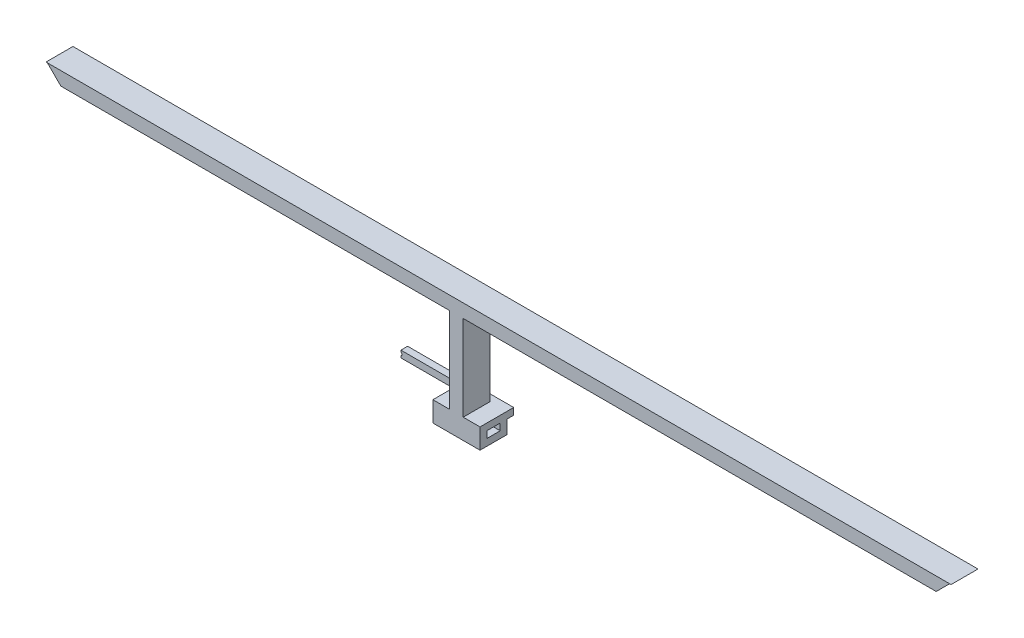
ISO-10303-21;
HEADER;
FILE_DESCRIPTION(('STEP AP214'),'2;1');
FILE_NAME('part.step','',(''),(''),'','','');
FILE_SCHEMA(('AUTOMOTIVE_DESIGN { 1 0 10303 214 1 1 1 1 }'));
ENDSEC;
DATA;
#1=APPLICATION_CONTEXT('core data for automotive mechanical design processes');
#2=APPLICATION_PROTOCOL_DEFINITION('international standard','automotive_design',2000,#1);
#3=PRODUCT_CONTEXT('',#1,'mechanical');
#4=PRODUCT('Part','Part','',(#3));
#5=PRODUCT_RELATED_PRODUCT_CATEGORY('part','',(#4));
#6=PRODUCT_DEFINITION_FORMATION('','',#4);
#7=PRODUCT_DEFINITION_CONTEXT('part definition',#1,'design');
#8=PRODUCT_DEFINITION('design','',#6,#7);
#9=PRODUCT_DEFINITION_SHAPE('','',#8);
#10=(LENGTH_UNIT() NAMED_UNIT(*) SI_UNIT(.MILLI.,.METRE.));
#11=(NAMED_UNIT(*) PLANE_ANGLE_UNIT() SI_UNIT($,.RADIAN.));
#12=(NAMED_UNIT(*) SI_UNIT($,.STERADIAN.) SOLID_ANGLE_UNIT());
#13=UNCERTAINTY_MEASURE_WITH_UNIT(LENGTH_MEASURE(1.E-05),#10,'distance_accuracy_value','');
#14=(GEOMETRIC_REPRESENTATION_CONTEXT(3) GLOBAL_UNCERTAINTY_ASSIGNED_CONTEXT((#13)) GLOBAL_UNIT_ASSIGNED_CONTEXT((#10,
#11,#12)) REPRESENTATION_CONTEXT('',''));
#15=CARTESIAN_POINT('',(0.,0.,0.));
#16=DIRECTION('',(0.,0.,1.));
#17=DIRECTION('',(1.,0.,0.));
#18=AXIS2_PLACEMENT_3D('',#15,#16,#17);
#19=CARTESIAN_POINT('',(35.,10.,-20.));
#20=DIRECTION('',(0.,0.,1.));
#21=DIRECTION('',(1.,0.,0.));
#22=AXIS2_PLACEMENT_3D('',#19,#20,#21);
#23=PLANE('',#22);
#24=DIRECTION('',(1.,0.,0.));
#25=VECTOR('',#24,1.);
#26=CARTESIAN_POINT('',(35.,10.,-20.));
#27=LINE('',#26,#25);
#28=CARTESIAN_POINT('',(-10.,10.,-20.));
#29=VERTEX_POINT('',#28);
#30=CARTESIAN_POINT('',(10.,10.,-20.));
#31=VERTEX_POINT('',#30);
#32=EDGE_CURVE('E11',#29,#31,#27,.T.);
#33=ORIENTED_EDGE('',*,*,#32,.F.);
#34=DIRECTION('',(0.,-1.,0.));
#35=VECTOR('',#34,1.);
#36=CARTESIAN_POINT('',(-10.,137.,-20.));
#37=LINE('',#36,#35);
#38=CARTESIAN_POINT('',(-10.,137.,-20.));
#39=VERTEX_POINT('',#38);
#40=EDGE_CURVE('E592',#39,#29,#37,.T.);
#41=ORIENTED_EDGE('',*,*,#40,.F.);
#42=DIRECTION('',(-1.,0.,0.));
#43=VECTOR('',#42,1.);
#44=CARTESIAN_POINT('',(734.483,137.,-20.));
#45=LINE('',#44,#43);
#46=CARTESIAN_POINT('',(-587.445932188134,137.,-20.));
#47=VERTEX_POINT('',#46);
#48=EDGE_CURVE('E267',#39,#47,#45,.T.);
#49=ORIENTED_EDGE('',*,*,#48,.T.);
#50=DIRECTION('',(-0.707106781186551,0.707106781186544,0.));
#51=VECTOR('',#50,1.);
#52=CARTESIAN_POINT('',(-212.722966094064,-237.722966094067,-20.));
#53=LINE('',#52,#51);
#54=CARTESIAN_POINT('',(-605.981466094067,155.535533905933,-20.));
#55=VERTEX_POINT('',#54);
#56=EDGE_CURVE('E37',#47,#55,#53,.T.);
#57=ORIENTED_EDGE('',*,*,#56,.T.);
#58=CARTESIAN_POINT('',(-609.517,152.,-20.));
#59=DIRECTION('',(0.,0.,1.));
#60=DIRECTION('',(1.,0.,0.));
#61=AXIS2_PLACEMENT_3D('',#58,#59,#60);
#62=CIRCLE('',#61,5.);
#63=CARTESIAN_POINT('',(-609.517,157.,-20.));
#64=VERTEX_POINT('',#63);
#65=EDGE_CURVE('E252',#55,#64,#62,.T.);
#66=ORIENTED_EDGE('',*,*,#65,.T.);
#67=DIRECTION('',(-1.,0.,0.));
#68=VECTOR('',#67,1.);
#69=CARTESIAN_POINT('',(734.483,157.,-20.));
#70=LINE('',#69,#68);
#71=CARTESIAN_POINT('',(734.483,157.,-20.));
#72=VERTEX_POINT('',#71);
#73=EDGE_CURVE('E264',#72,#64,#70,.T.);
#74=ORIENTED_EDGE('',*,*,#73,.F.);
#75=CARTESIAN_POINT('',(734.483,152.,-20.));
#76=DIRECTION('',(0.,0.,1.));
#77=DIRECTION('',(1.,0.,0.));
#78=AXIS2_PLACEMENT_3D('',#75,#76,#77);
#79=CIRCLE('',#78,4.99999999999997);
#80=CARTESIAN_POINT('',(730.947466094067,155.535533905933,-20.));
#81=VERTEX_POINT('',#80);
#82=EDGE_CURVE('E237',#72,#81,#79,.T.);
#83=ORIENTED_EDGE('',*,*,#82,.T.);
#84=DIRECTION('',(-0.707106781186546,-0.707106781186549,0.));
#85=VECTOR('',#84,1.);
#86=CARTESIAN_POINT('',(310.205966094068,-265.205966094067,-20.));
#87=LINE('',#86,#85);
#88=CARTESIAN_POINT('',(712.411932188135,137.,-20.));
#89=VERTEX_POINT('',#88);
#90=EDGE_CURVE('E241',#81,#89,#87,.T.);
#91=ORIENTED_EDGE('',*,*,#90,.T.);
#92=CARTESIAN_POINT('',(10.,137.,-20.));
#93=VERTEX_POINT('',#92);
#94=EDGE_CURVE('E276',#89,#93,#45,.T.);
#95=ORIENTED_EDGE('',*,*,#94,.T.);
#96=DIRECTION('',(0.,-1.,0.));
#97=VECTOR('',#96,1.);
#98=CARTESIAN_POINT('',(10.,137.,-20.));
#99=LINE('',#98,#97);
#100=EDGE_CURVE('E597',#93,#31,#99,.T.);
#101=ORIENTED_EDGE('',*,*,#100,.T.);
#102=EDGE_LOOP('',(#33,#41,#49,#57,#66,#74,#83,#91,#95,#101));
#103=FACE_BOUND('',#102,.T.);
#104=ADVANCED_FACE('F28',(#103),#23,.F.);
#105=DIRECTION('',(-1.,0.,0.));
#106=VECTOR('',#105,1.);
#107=CARTESIAN_POINT('',(35.,0.,-20.));
#108=LINE('',#107,#106);
#109=CARTESIAN_POINT('',(35.,0.,-20.));
#110=VERTEX_POINT('',#109);
#111=CARTESIAN_POINT('',(-35.,0.,-20.));
#112=VERTEX_POINT('',#111);
#113=EDGE_CURVE('E45',#110,#112,#108,.T.);
#114=ORIENTED_EDGE('',*,*,#113,.F.);
#115=DIRECTION('',(0.,1.,0.));
#116=VECTOR('',#115,1.);
#117=CARTESIAN_POINT('',(35.,10.,-20.));
#118=LINE('',#117,#116);
#119=CARTESIAN_POINT('',(35.,-20.,-20.));
#120=VERTEX_POINT('',#119);
#121=EDGE_CURVE('E281',#120,#110,#118,.T.);
#122=ORIENTED_EDGE('',*,*,#121,.F.);
#123=DIRECTION('',(-1.,0.,0.));
#124=VECTOR('',#123,1.);
#125=CARTESIAN_POINT('',(35.,-20.,-20.));
#126=LINE('',#125,#124);
#127=CARTESIAN_POINT('',(-35.,-20.,-20.));
#128=VERTEX_POINT('',#127);
#129=EDGE_CURVE('E293',#120,#128,#126,.T.);
#130=ORIENTED_EDGE('',*,*,#129,.T.);
#131=DIRECTION('',(0.,1.,0.));
#132=VECTOR('',#131,1.);
#133=CARTESIAN_POINT('',(-35.,10.,-20.));
#134=LINE('',#133,#132);
#135=EDGE_CURVE('E311',#128,#112,#134,.T.);
#136=ORIENTED_EDGE('',*,*,#135,.T.);
#137=EDGE_LOOP('',(#114,#122,#130,#136));
#138=FACE_BOUND('',#137,.T.);
#139=ADVANCED_FACE('F310',(#138),#23,.F.);
#140=CARTESIAN_POINT('',(35.,10.,20.));
#141=DIRECTION('',(0.,-1.,0.));
#142=DIRECTION('',(0.,0.,-1.));
#143=AXIS2_PLACEMENT_3D('',#140,#141,#142);
#144=PLANE('',#143);
#145=DIRECTION('',(0.,0.,1.));
#146=VECTOR('',#145,1.);
#147=CARTESIAN_POINT('',(-10.,10.,-20.));
#148=LINE('',#147,#146);
#149=CARTESIAN_POINT('',(-10.,10.,20.));
#150=VERTEX_POINT('',#149);
#151=EDGE_CURVE('E571',#29,#150,#148,.T.);
#152=ORIENTED_EDGE('',*,*,#151,.F.);
#153=ORIENTED_EDGE('',*,*,#32,.T.);
#154=DIRECTION('',(0.,0.,-1.));
#155=VECTOR('',#154,1.);
#156=CARTESIAN_POINT('',(10.,10.,-20.));
#157=LINE('',#156,#155);
#158=CARTESIAN_POINT('',(10.,10.,20.));
#159=VERTEX_POINT('',#158);
#160=EDGE_CURVE('E566',#159,#31,#157,.T.);
#161=ORIENTED_EDGE('',*,*,#160,.F.);
#162=DIRECTION('',(-1.,0.,0.));
#163=VECTOR('',#162,1.);
#164=CARTESIAN_POINT('',(35.,10.,20.));
#165=LINE('',#164,#163);
#166=CARTESIAN_POINT('',(35.,10.,20.));
#167=VERTEX_POINT('',#166);
#168=EDGE_CURVE('E299',#167,#159,#165,.T.);
#169=ORIENTED_EDGE('',*,*,#168,.F.);
#170=DIRECTION('',(0.,0.,1.));
#171=VECTOR('',#170,1.);
#172=CARTESIAN_POINT('',(35.,10.,20.));
#173=LINE('',#172,#171);
#174=CARTESIAN_POINT('',(35.,10.,-30.));
#175=VERTEX_POINT('',#174);
#176=EDGE_CURVE('E283',#175,#167,#173,.T.);
#177=ORIENTED_EDGE('',*,*,#176,.F.);
#178=DIRECTION('',(1.,0.,0.));
#179=VECTOR('',#178,1.);
#180=CARTESIAN_POINT('',(35.,10.,-30.));
#181=LINE('',#180,#179);
#182=CARTESIAN_POINT('',(-122.517,10.,-30.));
#183=VERTEX_POINT('',#182);
#184=EDGE_CURVE('E638',#183,#175,#181,.T.);
#185=ORIENTED_EDGE('',*,*,#184,.F.);
#186=DIRECTION('',(0.,0.,1.));
#187=VECTOR('',#186,1.);
#188=CARTESIAN_POINT('',(-122.517,10.,-30.));
#189=LINE('',#188,#187);
#190=CARTESIAN_POINT('',(-122.517,10.,-20.));
#191=VERTEX_POINT('',#190);
#192=EDGE_CURVE('E636',#183,#191,#189,.T.);
#193=ORIENTED_EDGE('',*,*,#192,.T.);
#194=CARTESIAN_POINT('',(-35.,10.,-20.));
#195=VERTEX_POINT('',#194);
#196=EDGE_CURVE('E217',#191,#195,#27,.T.);
#197=ORIENTED_EDGE('',*,*,#196,.T.);
#198=DIRECTION('',(0.,0.,1.));
#199=VECTOR('',#198,1.);
#200=CARTESIAN_POINT('',(-35.,10.,20.));
#201=LINE('',#200,#199);
#202=CARTESIAN_POINT('',(-35.,10.,20.));
#203=VERTEX_POINT('',#202);
#204=EDGE_CURVE('E319',#195,#203,#201,.T.);
#205=ORIENTED_EDGE('',*,*,#204,.T.);
#206=EDGE_CURVE('E290',#150,#203,#165,.T.);
#207=ORIENTED_EDGE('',*,*,#206,.F.);
#208=EDGE_LOOP('',(#152,#153,#161,#169,#177,#185,#193,#197,#205,#207));
#209=FACE_BOUND('',#208,.T.);
#210=ADVANCED_FACE('F355',(#209),#144,.F.);
#211=CARTESIAN_POINT('',(35.,-20.,20.));
#212=DIRECTION('',(1.,0.,0.));
#213=DIRECTION('',(0.,0.,-1.));
#214=AXIS2_PLACEMENT_3D('',#211,#212,#213);
#215=PLANE('',#214);
#216=DIRECTION('',(0.,-1.,0.));
#217=VECTOR('',#216,1.);
#218=CARTESIAN_POINT('',(35.,10.,20.));
#219=LINE('',#218,#217);
#220=CARTESIAN_POINT('',(35.,-20.,20.));
#221=VERTEX_POINT('',#220);
#222=EDGE_CURVE('E322',#167,#221,#219,.T.);
#223=ORIENTED_EDGE('',*,*,#222,.T.);
#224=DIRECTION('',(0.,0.,-1.));
#225=VECTOR('',#224,1.);
#226=CARTESIAN_POINT('',(35.,-20.,20.));
#227=LINE('',#226,#225);
#228=EDGE_CURVE('E284',#221,#120,#227,.T.);
#229=ORIENTED_EDGE('',*,*,#228,.T.);
#230=ORIENTED_EDGE('',*,*,#121,.T.);
#231=DIRECTION('',(0.,0.,1.));
#232=VECTOR('',#231,1.);
#233=CARTESIAN_POINT('',(35.,0.,-30.));
#234=LINE('',#233,#232);
#235=CARTESIAN_POINT('',(35.,0.,-30.));
#236=VERTEX_POINT('',#235);
#237=EDGE_CURVE('E203',#236,#110,#234,.T.);
#238=ORIENTED_EDGE('',*,*,#237,.F.);
#239=DIRECTION('',(0.,-1.,0.));
#240=VECTOR('',#239,1.);
#241=CARTESIAN_POINT('',(35.,0.,-30.));
#242=LINE('',#241,#240);
#243=EDGE_CURVE('E220',#175,#236,#242,.T.);
#244=ORIENTED_EDGE('',*,*,#243,.F.);
#245=ORIENTED_EDGE('',*,*,#176,.T.);
#246=EDGE_LOOP('',(#223,#229,#230,#238,#244,#245));
#247=FACE_BOUND('',#246,.T.);
#248=DIRECTION('',(0.,0.,-1.));
#249=VECTOR('',#248,1.);
#250=CARTESIAN_POINT('',(35.,-10.,10.));
#251=LINE('',#250,#249);
#252=CARTESIAN_POINT('',(35.,-10.,10.));
#253=VERTEX_POINT('',#252);
#254=CARTESIAN_POINT('',(35.,-10.,-10.));
#255=VERTEX_POINT('',#254);
#256=EDGE_CURVE('E615',#253,#255,#251,.T.);
#257=ORIENTED_EDGE('',*,*,#256,.F.);
#258=DIRECTION('',(0.,-1.,0.));
#259=VECTOR('',#258,1.);
#260=CARTESIAN_POINT('',(35.,0.,10.));
#261=LINE('',#260,#259);
#262=CARTESIAN_POINT('',(35.,0.,10.));
#263=VERTEX_POINT('',#262);
#264=EDGE_CURVE('E613',#263,#253,#261,.T.);
#265=ORIENTED_EDGE('',*,*,#264,.F.);
#266=DIRECTION('',(0.,0.,1.));
#267=VECTOR('',#266,1.);
#268=CARTESIAN_POINT('',(35.,0.,10.));
#269=LINE('',#268,#267);
#270=CARTESIAN_POINT('',(35.,0.,-10.));
#271=VERTEX_POINT('',#270);
#272=EDGE_CURVE('E620',#271,#263,#269,.T.);
#273=ORIENTED_EDGE('',*,*,#272,.F.);
#274=DIRECTION('',(0.,1.,0.));
#275=VECTOR('',#274,1.);
#276=CARTESIAN_POINT('',(35.,0.,-10.));
#277=LINE('',#276,#275);
#278=EDGE_CURVE('E617',#255,#271,#277,.T.);
#279=ORIENTED_EDGE('',*,*,#278,.F.);
#280=EDGE_LOOP('',(#257,#265,#273,#279));
#281=FACE_BOUND('',#280,.T.);
#282=ADVANCED_FACE('F336',(#247,#281),#215,.T.);
#283=CARTESIAN_POINT('',(-35.,-20.,20.));
#284=DIRECTION('',(1.,0.,0.));
#285=DIRECTION('',(0.,0.,-1.));
#286=AXIS2_PLACEMENT_3D('',#283,#284,#285);
#287=PLANE('',#286);
#288=DIRECTION('',(0.,-1.,0.));
#289=VECTOR('',#288,1.);
#290=CARTESIAN_POINT('',(-35.,10.,20.));
#291=LINE('',#290,#289);
#292=CARTESIAN_POINT('',(-35.,-20.,20.));
#293=VERTEX_POINT('',#292);
#294=EDGE_CURVE('E631',#203,#293,#291,.T.);
#295=ORIENTED_EDGE('',*,*,#294,.F.);
#296=ORIENTED_EDGE('',*,*,#204,.F.);
#297=EDGE_CURVE('E318',#112,#195,#134,.T.);
#298=ORIENTED_EDGE('',*,*,#297,.F.);
#299=ORIENTED_EDGE('',*,*,#135,.F.);
#300=DIRECTION('',(0.,0.,-1.));
#301=VECTOR('',#300,1.);
#302=CARTESIAN_POINT('',(-35.,-20.,20.));
#303=LINE('',#302,#301);
#304=EDGE_CURVE('E317',#293,#128,#303,.T.);
#305=ORIENTED_EDGE('',*,*,#304,.F.);
#306=EDGE_LOOP('',(#295,#296,#298,#299,#305));
#307=FACE_BOUND('',#306,.T.);
#308=DIRECTION('',(0.,-1.,0.));
#309=VECTOR('',#308,1.);
#310=CARTESIAN_POINT('',(-35.,0.,10.));
#311=LINE('',#310,#309);
#312=CARTESIAN_POINT('',(-35.,0.,10.));
#313=VERTEX_POINT('',#312);
#314=CARTESIAN_POINT('',(-35.,-10.,10.));
#315=VERTEX_POINT('',#314);
#316=EDGE_CURVE('E599',#313,#315,#311,.T.);
#317=ORIENTED_EDGE('',*,*,#316,.T.);
#318=DIRECTION('',(0.,0.,-1.));
#319=VECTOR('',#318,1.);
#320=CARTESIAN_POINT('',(-35.,-10.,10.));
#321=LINE('',#320,#319);
#322=CARTESIAN_POINT('',(-35.,-10.,-10.));
#323=VERTEX_POINT('',#322);
#324=EDGE_CURVE('E601',#315,#323,#321,.T.);
#325=ORIENTED_EDGE('',*,*,#324,.T.);
#326=DIRECTION('',(0.,1.,0.));
#327=VECTOR('',#326,1.);
#328=CARTESIAN_POINT('',(-35.,0.,-10.));
#329=LINE('',#328,#327);
#330=CARTESIAN_POINT('',(-35.,0.,-10.));
#331=VERTEX_POINT('',#330);
#332=EDGE_CURVE('E605',#323,#331,#329,.T.);
#333=ORIENTED_EDGE('',*,*,#332,.T.);
#334=DIRECTION('',(0.,0.,1.));
#335=VECTOR('',#334,1.);
#336=CARTESIAN_POINT('',(-35.,0.,10.));
#337=LINE('',#336,#335);
#338=EDGE_CURVE('E611',#331,#313,#337,.T.);
#339=ORIENTED_EDGE('',*,*,#338,.T.);
#340=EDGE_LOOP('',(#317,#325,#333,#339));
#341=FACE_BOUND('',#340,.T.);
#342=ADVANCED_FACE('F315',(#307,#341),#287,.F.);
#343=CARTESIAN_POINT('',(35.,10.,20.));
#344=DIRECTION('',(0.,0.,-1.));
#345=DIRECTION('',(-1.,0.,0.));
#346=AXIS2_PLACEMENT_3D('',#343,#344,#345);
#347=PLANE('',#346);
#348=DIRECTION('',(-1.,0.,0.));
#349=VECTOR('',#348,1.);
#350=CARTESIAN_POINT('',(734.483,137.,20.));
#351=LINE('',#350,#349);
#352=CARTESIAN_POINT('',(712.411932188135,137.,20.));
#353=VERTEX_POINT('',#352);
#354=CARTESIAN_POINT('',(10.,137.,20.));
#355=VERTEX_POINT('',#354);
#356=EDGE_CURVE('E279',#353,#355,#351,.T.);
#357=ORIENTED_EDGE('',*,*,#356,.F.);
#358=DIRECTION('',(-0.707106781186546,-0.707106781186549,0.));
#359=VECTOR('',#358,1.);
#360=CARTESIAN_POINT('',(730.947466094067,155.535533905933,20.));
#361=LINE('',#360,#359);
#362=CARTESIAN_POINT('',(730.947466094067,155.535533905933,20.));
#363=VERTEX_POINT('',#362);
#364=EDGE_CURVE('E231',#363,#353,#361,.T.);
#365=ORIENTED_EDGE('',*,*,#364,.F.);
#366=CARTESIAN_POINT('',(734.483,152.,20.));
#367=DIRECTION('',(0.,0.,1.));
#368=DIRECTION('',(1.,0.,0.));
#369=AXIS2_PLACEMENT_3D('',#366,#367,#368);
#370=CIRCLE('',#369,4.99999999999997);
#371=CARTESIAN_POINT('',(734.483,157.,20.));
#372=VERTEX_POINT('',#371);
#373=EDGE_CURVE('E228',#372,#363,#370,.T.);
#374=ORIENTED_EDGE('',*,*,#373,.F.);
#375=DIRECTION('',(-1.,0.,0.));
#376=VECTOR('',#375,1.);
#377=CARTESIAN_POINT('',(734.483,157.,20.));
#378=LINE('',#377,#376);
#379=CARTESIAN_POINT('',(-609.517,157.,20.));
#380=VERTEX_POINT('',#379);
#381=EDGE_CURVE('E261',#372,#380,#378,.T.);
#382=ORIENTED_EDGE('',*,*,#381,.T.);
#383=CARTESIAN_POINT('',(-609.517,152.,20.));
#384=DIRECTION('',(0.,0.,1.));
#385=DIRECTION('',(1.,0.,0.));
#386=AXIS2_PLACEMENT_3D('',#383,#384,#385);
#387=CIRCLE('',#386,5.);
#388=CARTESIAN_POINT('',(-605.981466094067,155.535533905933,20.));
#389=VERTEX_POINT('',#388);
#390=EDGE_CURVE('E247',#389,#380,#387,.T.);
#391=ORIENTED_EDGE('',*,*,#390,.F.);
#392=DIRECTION('',(-0.707106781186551,0.707106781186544,0.));
#393=VECTOR('',#392,1.);
#394=CARTESIAN_POINT('',(-605.981466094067,155.535533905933,20.));
#395=LINE('',#394,#393);
#396=CARTESIAN_POINT('',(-587.445932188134,137.,20.));
#397=VERTEX_POINT('',#396);
#398=EDGE_CURVE('E244',#397,#389,#395,.T.);
#399=ORIENTED_EDGE('',*,*,#398,.F.);
#400=CARTESIAN_POINT('',(-10.,137.,20.));
#401=VERTEX_POINT('',#400);
#402=EDGE_CURVE('E278',#401,#397,#351,.T.);
#403=ORIENTED_EDGE('',*,*,#402,.F.);
#404=DIRECTION('',(0.,-1.,0.));
#405=VECTOR('',#404,1.);
#406=CARTESIAN_POINT('',(-10.,137.,20.));
#407=LINE('',#406,#405);
#408=EDGE_CURVE('E590',#401,#150,#407,.T.);
#409=ORIENTED_EDGE('',*,*,#408,.T.);
#410=ORIENTED_EDGE('',*,*,#206,.T.);
#411=ORIENTED_EDGE('',*,*,#294,.T.);
#412=DIRECTION('',(-1.,0.,0.));
#413=VECTOR('',#412,1.);
#414=CARTESIAN_POINT('',(35.,-20.,20.));
#415=LINE('',#414,#413);
#416=EDGE_CURVE('E301',#221,#293,#415,.T.);
#417=ORIENTED_EDGE('',*,*,#416,.F.);
#418=ORIENTED_EDGE('',*,*,#222,.F.);
#419=ORIENTED_EDGE('',*,*,#168,.T.);
#420=DIRECTION('',(0.,-1.,0.));
#421=VECTOR('',#420,1.);
#422=CARTESIAN_POINT('',(10.,137.,20.));
#423=LINE('',#422,#421);
#424=EDGE_CURVE('E581',#355,#159,#423,.T.);
#425=ORIENTED_EDGE('',*,*,#424,.F.);
#426=EDGE_LOOP('',(#357,#365,#374,#382,#391,#399,#403,#409,#410,#411,#417,#418,#419,#425));
#427=FACE_BOUND('',#426,.T.);
#428=ADVANCED_FACE('F30',(#427),#347,.F.);
#429=CARTESIAN_POINT('',(35.,-20.,20.));
#430=DIRECTION('',(0.,1.,0.));
#431=DIRECTION('',(0.,0.,1.));
#432=AXIS2_PLACEMENT_3D('',#429,#430,#431);
#433=PLANE('',#432);
#434=ORIENTED_EDGE('',*,*,#304,.T.);
#435=ORIENTED_EDGE('',*,*,#129,.F.);
#436=ORIENTED_EDGE('',*,*,#228,.F.);
#437=ORIENTED_EDGE('',*,*,#416,.T.);
#438=EDGE_LOOP('',(#434,#435,#436,#437));
#439=FACE_BOUND('',#438,.T.);
#440=ADVANCED_FACE('F339',(#439),#433,.F.);
#441=CARTESIAN_POINT('',(35.,0.,10.));
#442=DIRECTION('',(0.,0.,-1.));
#443=DIRECTION('',(-1.,0.,0.));
#444=AXIS2_PLACEMENT_3D('',#441,#442,#443);
#445=PLANE('',#444);
#446=ORIENTED_EDGE('',*,*,#316,.F.);
#447=DIRECTION('',(-1.,0.,0.));
#448=VECTOR('',#447,1.);
#449=CARTESIAN_POINT('',(35.,0.,10.));
#450=LINE('',#449,#448);
#451=EDGE_CURVE('E622',#263,#313,#450,.T.);
#452=ORIENTED_EDGE('',*,*,#451,.F.);
#453=ORIENTED_EDGE('',*,*,#264,.T.);
#454=DIRECTION('',(-1.,0.,0.));
#455=VECTOR('',#454,1.);
#456=CARTESIAN_POINT('',(35.,-10.,10.));
#457=LINE('',#456,#455);
#458=EDGE_CURVE('E629',#253,#315,#457,.T.);
#459=ORIENTED_EDGE('',*,*,#458,.T.);
#460=EDGE_LOOP('',(#446,#452,#453,#459));
#461=FACE_BOUND('',#460,.T.);
#462=ADVANCED_FACE('F341',(#461),#445,.T.);
#463=CARTESIAN_POINT('',(35.,-10.,10.));
#464=DIRECTION('',(0.,1.,0.));
#465=DIRECTION('',(0.,0.,1.));
#466=AXIS2_PLACEMENT_3D('',#463,#464,#465);
#467=PLANE('',#466);
#468=ORIENTED_EDGE('',*,*,#324,.F.);
#469=ORIENTED_EDGE('',*,*,#458,.F.);
#470=ORIENTED_EDGE('',*,*,#256,.T.);
#471=DIRECTION('',(-1.,0.,0.));
#472=VECTOR('',#471,1.);
#473=CARTESIAN_POINT('',(35.,-10.,-10.));
#474=LINE('',#473,#472);
#475=EDGE_CURVE('E627',#255,#323,#474,.T.);
#476=ORIENTED_EDGE('',*,*,#475,.T.);
#477=EDGE_LOOP('',(#468,#469,#470,#476));
#478=FACE_BOUND('',#477,.T.);
#479=ADVANCED_FACE('F346',(#478),#467,.T.);
#480=CARTESIAN_POINT('',(35.,0.,-10.));
#481=DIRECTION('',(0.,0.,1.));
#482=DIRECTION('',(1.,0.,0.));
#483=AXIS2_PLACEMENT_3D('',#480,#481,#482);
#484=PLANE('',#483);
#485=ORIENTED_EDGE('',*,*,#332,.F.);
#486=ORIENTED_EDGE('',*,*,#475,.F.);
#487=ORIENTED_EDGE('',*,*,#278,.T.);
#488=DIRECTION('',(-1.,0.,0.));
#489=VECTOR('',#488,1.);
#490=CARTESIAN_POINT('',(35.,0.,-10.));
#491=LINE('',#490,#489);
#492=EDGE_CURVE('E625',#271,#331,#491,.T.);
#493=ORIENTED_EDGE('',*,*,#492,.T.);
#494=EDGE_LOOP('',(#485,#486,#487,#493));
#495=FACE_BOUND('',#494,.T.);
#496=ADVANCED_FACE('F366',(#495),#484,.T.);
#497=CARTESIAN_POINT('',(35.,0.,10.));
#498=DIRECTION('',(0.,-1.,0.));
#499=DIRECTION('',(0.,0.,-1.));
#500=AXIS2_PLACEMENT_3D('',#497,#498,#499);
#501=PLANE('',#500);
#502=ORIENTED_EDGE('',*,*,#338,.F.);
#503=ORIENTED_EDGE('',*,*,#492,.F.);
#504=ORIENTED_EDGE('',*,*,#272,.T.);
#505=ORIENTED_EDGE('',*,*,#451,.T.);
#506=EDGE_LOOP('',(#502,#503,#504,#505));
#507=FACE_BOUND('',#506,.T.);
#508=ADVANCED_FACE('F370',(#507),#501,.T.);
#509=CARTESIAN_POINT('',(10.,137.,-20.));
#510=DIRECTION('',(-1.,0.,0.));
#511=DIRECTION('',(0.,0.,1.));
#512=AXIS2_PLACEMENT_3D('',#509,#510,#511);
#513=PLANE('',#512);
#514=ORIENTED_EDGE('',*,*,#160,.T.);
#515=ORIENTED_EDGE('',*,*,#100,.F.);
#516=DIRECTION('',(0.,0.,-1.));
#517=VECTOR('',#516,1.);
#518=CARTESIAN_POINT('',(10.,137.,-20.));
#519=LINE('',#518,#517);
#520=EDGE_CURVE('E576',#355,#93,#519,.T.);
#521=ORIENTED_EDGE('',*,*,#520,.F.);
#522=ORIENTED_EDGE('',*,*,#424,.T.);
#523=EDGE_LOOP('',(#514,#515,#521,#522));
#524=FACE_BOUND('',#523,.T.);
#525=ADVANCED_FACE('F374',(#524),#513,.F.);
#526=CARTESIAN_POINT('',(-10.,137.,-20.));
#527=DIRECTION('',(1.,0.,0.));
#528=DIRECTION('',(0.,0.,-1.));
#529=AXIS2_PLACEMENT_3D('',#526,#527,#528);
#530=PLANE('',#529);
#531=ORIENTED_EDGE('',*,*,#151,.T.);
#532=ORIENTED_EDGE('',*,*,#408,.F.);
#533=DIRECTION('',(0.,0.,1.));
#534=VECTOR('',#533,1.);
#535=CARTESIAN_POINT('',(-10.,137.,-20.));
#536=LINE('',#535,#534);
#537=EDGE_CURVE('E563',#39,#401,#536,.T.);
#538=ORIENTED_EDGE('',*,*,#537,.F.);
#539=ORIENTED_EDGE('',*,*,#40,.T.);
#540=EDGE_LOOP('',(#531,#532,#538,#539));
#541=FACE_BOUND('',#540,.T.);
#542=ADVANCED_FACE('F378',(#541),#530,.F.);
#543=CARTESIAN_POINT('',(734.483,137.,20.));
#544=DIRECTION('',(0.,1.,0.));
#545=DIRECTION('',(0.,0.,1.));
#546=AXIS2_PLACEMENT_3D('',#543,#544,#545);
#547=PLANE('',#546);
#548=ORIENTED_EDGE('',*,*,#94,.F.);
#549=DIRECTION('',(0.,0.,1.));
#550=VECTOR('',#549,1.);
#551=CARTESIAN_POINT('',(712.411932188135,137.,-20.00005));
#552=LINE('',#551,#550);
#553=EDGE_CURVE('E234',#89,#353,#552,.T.);
#554=ORIENTED_EDGE('',*,*,#553,.T.);
#555=ORIENTED_EDGE('',*,*,#356,.T.);
#556=ORIENTED_EDGE('',*,*,#520,.T.);
#557=EDGE_LOOP('',(#548,#554,#555,#556));
#558=FACE_BOUND('',#557,.T.);
#559=ADVANCED_FACE('F382',(#558),#547,.F.);
#560=ORIENTED_EDGE('',*,*,#402,.T.);
#561=DIRECTION('',(0.,0.,1.));
#562=VECTOR('',#561,1.);
#563=CARTESIAN_POINT('',(-587.445932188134,137.,-20.00005));
#564=LINE('',#563,#562);
#565=EDGE_CURVE('E250',#47,#397,#564,.T.);
#566=ORIENTED_EDGE('',*,*,#565,.F.);
#567=ORIENTED_EDGE('',*,*,#48,.F.);
#568=ORIENTED_EDGE('',*,*,#537,.T.);
#569=EDGE_LOOP('',(#560,#566,#567,#568));
#570=FACE_BOUND('',#569,.T.);
#571=ADVANCED_FACE('F386',(#570),#547,.F.);
#572=CARTESIAN_POINT('',(734.483,157.,20.));
#573=DIRECTION('',(0.,-1.,0.));
#574=DIRECTION('',(0.,0.,-1.));
#575=AXIS2_PLACEMENT_3D('',#572,#573,#574);
#576=PLANE('',#575);
#577=ORIENTED_EDGE('',*,*,#73,.T.);
#578=DIRECTION('',(0.,0.,1.));
#579=VECTOR('',#578,1.);
#580=CARTESIAN_POINT('',(-609.517,157.,20.));
#581=LINE('',#580,#579);
#582=EDGE_CURVE('E256',#64,#380,#581,.T.);
#583=ORIENTED_EDGE('',*,*,#582,.T.);
#584=ORIENTED_EDGE('',*,*,#381,.F.);
#585=DIRECTION('',(0.,0.,1.));
#586=VECTOR('',#585,1.);
#587=CARTESIAN_POINT('',(734.483,157.,20.));
#588=LINE('',#587,#586);
#589=EDGE_CURVE('E259',#72,#372,#588,.T.);
#590=ORIENTED_EDGE('',*,*,#589,.F.);
#591=EDGE_LOOP('',(#577,#583,#584,#590));
#592=FACE_BOUND('',#591,.T.);
#593=ADVANCED_FACE('F388',(#592),#576,.F.);
#594=CARTESIAN_POINT('',(-605.981466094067,155.535533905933,-20.00005));
#595=DIRECTION('',(0.707106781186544,0.707106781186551,0.));
#596=DIRECTION('',(-0.707106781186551,0.707106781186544,0.));
#597=AXIS2_PLACEMENT_3D('',#594,#595,#596);
#598=PLANE('',#597);
#599=ORIENTED_EDGE('',*,*,#565,.T.);
#600=ORIENTED_EDGE('',*,*,#398,.T.);
#601=DIRECTION('',(0.,0.,1.));
#602=VECTOR('',#601,1.);
#603=CARTESIAN_POINT('',(-605.981466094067,155.535533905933,-20.00005));
#604=LINE('',#603,#602);
#605=EDGE_CURVE('E249',#55,#389,#604,.T.);
#606=ORIENTED_EDGE('',*,*,#605,.F.);
#607=ORIENTED_EDGE('',*,*,#56,.F.);
#608=EDGE_LOOP('',(#599,#600,#606,#607));
#609=FACE_BOUND('',#608,.T.);
#610=ADVANCED_FACE('F391',(#609),#598,.F.);
#611=CARTESIAN_POINT('',(-609.517,152.,-20.00005));
#612=DIRECTION('',(0.,0.,1.));
#613=DIRECTION('',(1.,0.,0.));
#614=AXIS2_PLACEMENT_3D('',#611,#612,#613);
#615=CYLINDRICAL_SURFACE('',#614,5.);
#616=ORIENTED_EDGE('',*,*,#605,.T.);
#617=ORIENTED_EDGE('',*,*,#390,.T.);
#618=ORIENTED_EDGE('',*,*,#582,.F.);
#619=ORIENTED_EDGE('',*,*,#65,.F.);
#620=EDGE_LOOP('',(#616,#617,#618,#619));
#621=FACE_BOUND('',#620,.T.);
#622=ADVANCED_FACE('F395',(#621),#615,.F.);
#623=CARTESIAN_POINT('',(730.947466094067,155.535533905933,-20.00005));
#624=DIRECTION('',(-0.707106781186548,0.707106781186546,0.));
#625=DIRECTION('',(-0.707106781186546,-0.707106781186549,0.));
#626=AXIS2_PLACEMENT_3D('',#623,#624,#625);
#627=PLANE('',#626);
#628=DIRECTION('',(0.,0.,1.));
#629=VECTOR('',#628,1.);
#630=CARTESIAN_POINT('',(730.947466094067,155.535533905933,-20.00005));
#631=LINE('',#630,#629);
#632=EDGE_CURVE('E233',#81,#363,#631,.T.);
#633=ORIENTED_EDGE('',*,*,#632,.T.);
#634=ORIENTED_EDGE('',*,*,#364,.T.);
#635=ORIENTED_EDGE('',*,*,#553,.F.);
#636=ORIENTED_EDGE('',*,*,#90,.F.);
#637=EDGE_LOOP('',(#633,#634,#635,#636));
#638=FACE_BOUND('',#637,.T.);
#639=ADVANCED_FACE('F399',(#638),#627,.F.);
#640=CARTESIAN_POINT('',(734.483,152.,-20.00005));
#641=DIRECTION('',(0.,0.,1.));
#642=DIRECTION('',(1.,0.,0.));
#643=AXIS2_PLACEMENT_3D('',#640,#641,#642);
#644=CYLINDRICAL_SURFACE('',#643,4.99999999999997);
#645=ORIENTED_EDGE('',*,*,#589,.T.);
#646=ORIENTED_EDGE('',*,*,#373,.T.);
#647=ORIENTED_EDGE('',*,*,#632,.F.);
#648=ORIENTED_EDGE('',*,*,#82,.F.);
#649=EDGE_LOOP('',(#645,#646,#647,#648));
#650=FACE_BOUND('',#649,.T.);
#651=ADVANCED_FACE('F401',(#650),#644,.F.);
#652=CARTESIAN_POINT('',(-122.517,5.,-20.));
#653=DIRECTION('',(0.,0.,-1.));
#654=DIRECTION('',(-1.,0.,0.));
#655=AXIS2_PLACEMENT_3D('',#652,#653,#654);
#656=PLANE('',#655);
#657=CARTESIAN_POINT('',(-122.517,0.,-20.));
#658=VERTEX_POINT('',#657);
#659=EDGE_CURVE('E187',#112,#658,#108,.T.);
#660=ORIENTED_EDGE('',*,*,#659,.F.);
#661=ORIENTED_EDGE('',*,*,#297,.T.);
#662=ORIENTED_EDGE('',*,*,#196,.F.);
#663=DIRECTION('',(0.,1.,0.));
#664=VECTOR('',#663,1.);
#665=CARTESIAN_POINT('',(-122.517,7.00000000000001,-20.));
#666=LINE('',#665,#664);
#667=CARTESIAN_POINT('',(-122.517,7.00000000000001,-20.));
#668=VERTEX_POINT('',#667);
#669=EDGE_CURVE('E211',#668,#191,#666,.T.);
#670=ORIENTED_EDGE('',*,*,#669,.F.);
#671=CARTESIAN_POINT('',(-122.517,5.,-20.));
#672=DIRECTION('',(0.,0.,1.));
#673=DIRECTION('',(-1.,0.,0.));
#674=AXIS2_PLACEMENT_3D('',#671,#672,#673);
#675=CIRCLE('',#674,2.00000000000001);
#676=CARTESIAN_POINT('',(-122.517,2.99999999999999,-20.));
#677=VERTEX_POINT('',#676);
#678=EDGE_CURVE('E209',#677,#668,#675,.T.);
#679=ORIENTED_EDGE('',*,*,#678,.F.);
#680=DIRECTION('',(0.,1.,0.));
#681=VECTOR('',#680,1.);
#682=CARTESIAN_POINT('',(-122.517,0.,-20.));
#683=LINE('',#682,#681);
#684=EDGE_CURVE('E200',#658,#677,#683,.T.);
#685=ORIENTED_EDGE('',*,*,#684,.F.);
#686=EDGE_LOOP('',(#660,#661,#662,#670,#679,#685));
#687=FACE_BOUND('',#686,.T.);
#688=ADVANCED_FACE('F207',(#687),#656,.F.);
#689=CARTESIAN_POINT('',(35.,0.,-30.));
#690=DIRECTION('',(0.,1.,0.));
#691=DIRECTION('',(0.,0.,1.));
#692=AXIS2_PLACEMENT_3D('',#689,#690,#691);
#693=PLANE('',#692);
#694=ORIENTED_EDGE('',*,*,#113,.T.);
#695=ORIENTED_EDGE('',*,*,#659,.T.);
#696=DIRECTION('',(0.,0.,1.));
#697=VECTOR('',#696,1.);
#698=CARTESIAN_POINT('',(-122.517,0.,-30.));
#699=LINE('',#698,#697);
#700=CARTESIAN_POINT('',(-122.517,0.,-30.));
#701=VERTEX_POINT('',#700);
#702=EDGE_CURVE('E190',#701,#658,#699,.T.);
#703=ORIENTED_EDGE('',*,*,#702,.F.);
#704=DIRECTION('',(-1.,0.,0.));
#705=VECTOR('',#704,1.);
#706=CARTESIAN_POINT('',(35.,0.,-30.));
#707=LINE('',#706,#705);
#708=EDGE_CURVE('E331',#236,#701,#707,.T.);
#709=ORIENTED_EDGE('',*,*,#708,.F.);
#710=ORIENTED_EDGE('',*,*,#237,.T.);
#711=EDGE_LOOP('',(#694,#695,#703,#709,#710));
#712=FACE_BOUND('',#711,.T.);
#713=ADVANCED_FACE('F189',(#712),#693,.F.);
#714=CARTESIAN_POINT('',(-122.517,0.,-30.));
#715=DIRECTION('',(1.,0.,0.));
#716=DIRECTION('',(0.,0.,-1.));
#717=AXIS2_PLACEMENT_3D('',#714,#715,#716);
#718=PLANE('',#717);
#719=ORIENTED_EDGE('',*,*,#684,.T.);
#720=DIRECTION('',(0.,0.,1.));
#721=VECTOR('',#720,1.);
#722=CARTESIAN_POINT('',(-122.517,2.99999999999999,-30.));
#723=LINE('',#722,#721);
#724=CARTESIAN_POINT('',(-122.517,2.99999999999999,-30.));
#725=VERTEX_POINT('',#724);
#726=EDGE_CURVE('E204',#725,#677,#723,.T.);
#727=ORIENTED_EDGE('',*,*,#726,.F.);
#728=DIRECTION('',(0.,1.,0.));
#729=VECTOR('',#728,1.);
#730=CARTESIAN_POINT('',(-122.517,0.,-30.));
#731=LINE('',#730,#729);
#732=EDGE_CURVE('E202',#701,#725,#731,.T.);
#733=ORIENTED_EDGE('',*,*,#732,.F.);
#734=ORIENTED_EDGE('',*,*,#702,.T.);
#735=EDGE_LOOP('',(#719,#727,#733,#734));
#736=FACE_BOUND('',#735,.T.);
#737=ADVANCED_FACE('F198',(#736),#718,.F.);
#738=CARTESIAN_POINT('',(-122.517,5.,-30.));
#739=DIRECTION('',(0.,0.,1.));
#740=DIRECTION('',(1.,0.,0.));
#741=AXIS2_PLACEMENT_3D('',#738,#739,#740);
#742=CYLINDRICAL_SURFACE('',#741,2.00000000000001);
#743=ORIENTED_EDGE('',*,*,#678,.T.);
#744=DIRECTION('',(0.,0.,1.));
#745=VECTOR('',#744,1.);
#746=CARTESIAN_POINT('',(-122.517,7.00000000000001,-30.));
#747=LINE('',#746,#745);
#748=CARTESIAN_POINT('',(-122.517,7.00000000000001,-30.));
#749=VERTEX_POINT('',#748);
#750=EDGE_CURVE('E640',#749,#668,#747,.T.);
#751=ORIENTED_EDGE('',*,*,#750,.F.);
#752=CARTESIAN_POINT('',(-122.517,5.,-30.));
#753=DIRECTION('',(0.,0.,1.));
#754=DIRECTION('',(-1.,0.,0.));
#755=AXIS2_PLACEMENT_3D('',#752,#753,#754);
#756=CIRCLE('',#755,2.00000000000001);
#757=EDGE_CURVE('E649',#725,#749,#756,.T.);
#758=ORIENTED_EDGE('',*,*,#757,.F.);
#759=ORIENTED_EDGE('',*,*,#726,.T.);
#760=EDGE_LOOP('',(#743,#751,#758,#759));
#761=FACE_BOUND('',#760,.T.);
#762=ADVANCED_FACE('F412',(#761),#742,.F.);
#763=CARTESIAN_POINT('',(-122.517,7.00000000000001,-30.));
#764=DIRECTION('',(1.,0.,0.));
#765=DIRECTION('',(0.,0.,-1.));
#766=AXIS2_PLACEMENT_3D('',#763,#764,#765);
#767=PLANE('',#766);
#768=ORIENTED_EDGE('',*,*,#669,.T.);
#769=ORIENTED_EDGE('',*,*,#192,.F.);
#770=DIRECTION('',(0.,1.,0.));
#771=VECTOR('',#770,1.);
#772=CARTESIAN_POINT('',(-122.517,7.00000000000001,-30.));
#773=LINE('',#772,#771);
#774=EDGE_CURVE('E644',#749,#183,#773,.T.);
#775=ORIENTED_EDGE('',*,*,#774,.F.);
#776=ORIENTED_EDGE('',*,*,#750,.T.);
#777=EDGE_LOOP('',(#768,#769,#775,#776));
#778=FACE_BOUND('',#777,.T.);
#779=ADVANCED_FACE('F415',(#778),#767,.F.);
#780=CARTESIAN_POINT('',(-122.517,5.,-30.));
#781=DIRECTION('',(0.,0.,-1.));
#782=DIRECTION('',(-1.,0.,0.));
#783=AXIS2_PLACEMENT_3D('',#780,#781,#782);
#784=PLANE('',#783);
#785=ORIENTED_EDGE('',*,*,#243,.T.);
#786=ORIENTED_EDGE('',*,*,#708,.T.);
#787=ORIENTED_EDGE('',*,*,#732,.T.);
#788=ORIENTED_EDGE('',*,*,#757,.T.);
#789=ORIENTED_EDGE('',*,*,#774,.T.);
#790=ORIENTED_EDGE('',*,*,#184,.T.);
#791=EDGE_LOOP('',(#785,#786,#787,#788,#789,#790));
#792=FACE_BOUND('',#791,.T.);
#793=ADVANCED_FACE('F419',(#792),#784,.T.);
#794=CLOSED_SHELL('',(#104,#139,#210,#282,#342,#428,#440,#462,#479,#496,#508,#525,#542,#559,
#571,#593,#610,#622,#639,#651,#688,#713,#737,#762,#779,#793));
#795=MANIFOLD_SOLID_BREP('B2',#794);
#796=ADVANCED_BREP_SHAPE_REPRESENTATION('',(#18,#795),#14);
#797=SHAPE_DEFINITION_REPRESENTATION(#9,#796);
ENDSEC;
END-ISO-10303-21;
